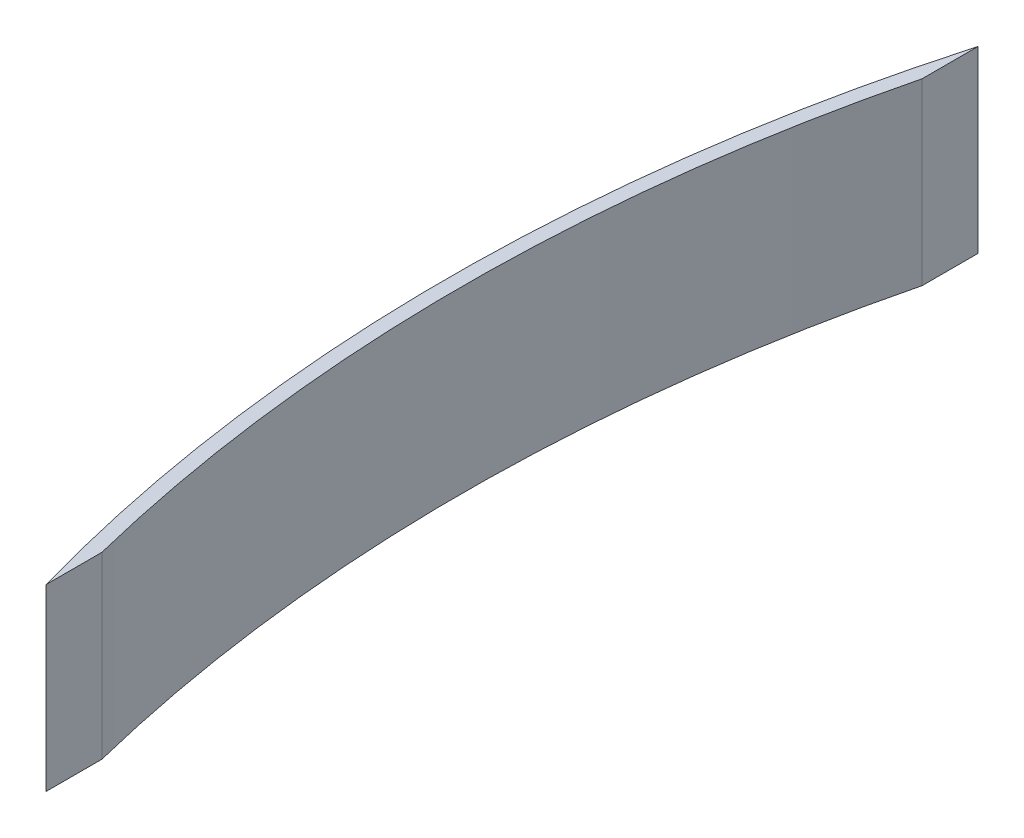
from build123d import *

# Parameters (mm, degrees)
ESTRUSIONE_ESTRUSIONE1_DEPTH = 2.5


with BuildPart() as part:
    # Schizzo1 → Estrusione-Estrusione1 (new body)
    with BuildSketch(Plane(origin=(0, 0, 0), x_dir=(1, 0, 0), z_dir=(0, 1, 0))):
        with BuildLine():
            Line((0, 6.5), (0, 5.72023698))
            ThreePointArc((0, 5.72023698), (-0.7, 0), (0, -5.72023698))
            Line((0, -5.72023698), (0, -6.5))
            ThreePointArc((0, -6.5), (-0.9, 0), (0, 6.5))
        make_face()
    extrude(amount=ESTRUSIONE_ESTRUSIONE1_DEPTH)


solid = part.part
